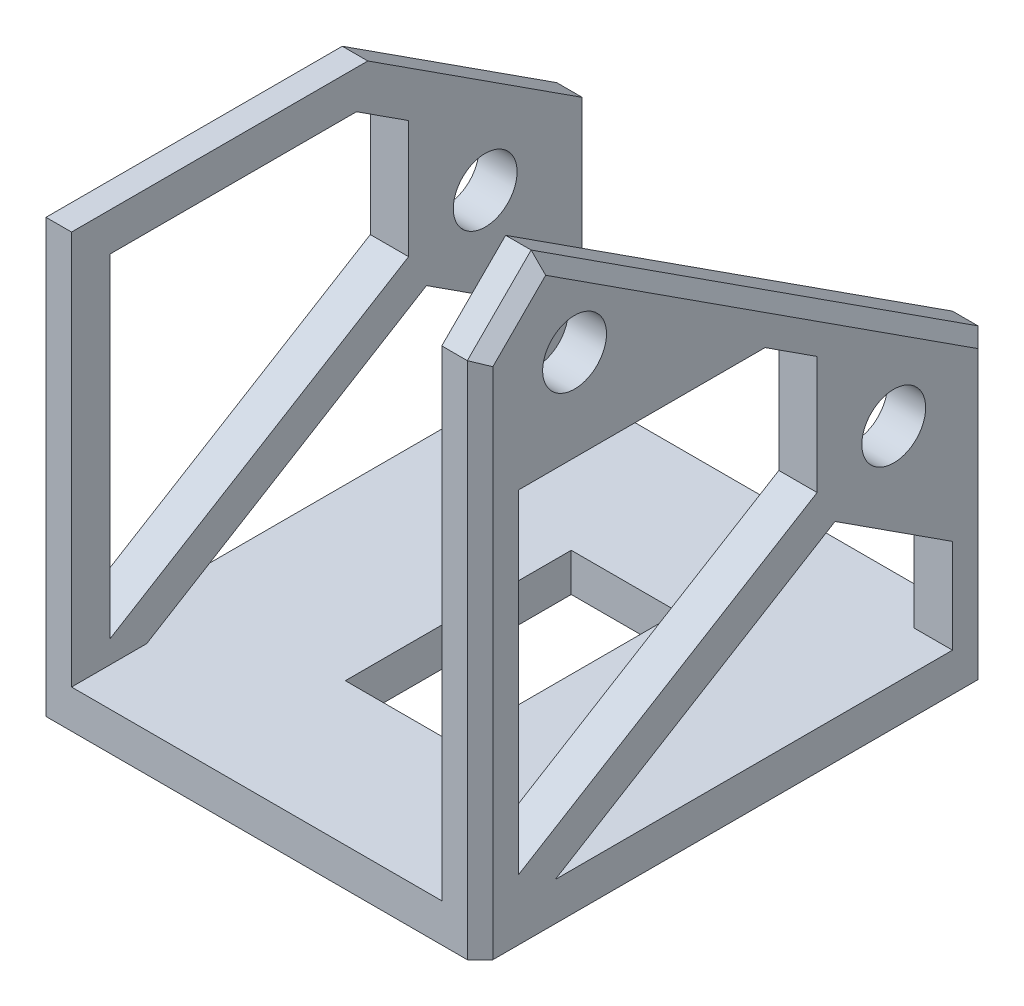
from build123d import *

# Parameters (mm, degrees)
CROQUIS1_W              = 35
CROQUIS1_H              = 40
CROQUIS1_W_2            = 8.413548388
CROQUIS1_H_2            = 17.69516129
SALIENTE_EXTRUIR2_DEPTH = 1.5
CROQUIS2_R              = 2.5
SALIENTE_EXTRUIR3_DEPTH = 3
SALIENTE_EXTRUIR4_START = -3
CROQUIS3_R              = 2.5
SALIENTE_EXTRUIR4_DEPTH = 3
CHAFL_N2_SIZE           = 1
CORTAR_EXTRUIR1_DEPTH   = 60.778382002


with BuildPart() as part:
    # Croquis1 → Saliente-Extruir2 (new, symmetric)
    with BuildSketch(Plane(origin=(0, 0, 0), x_dir=(1, 0, 0), z_dir=(0, 1, 0))):
        Rectangle(CROQUIS1_W, CROQUIS1_H)
        Rectangle(CROQUIS1_W_2, CROQUIS1_H_2, mode=Mode.SUBTRACT)
    extrude(amount=SALIENTE_EXTRUIR2_DEPTH, both=True)

    # Croquis2 → Saliente-Extruir3 (add)
    with BuildSketch(Plane(origin=(17.5, 0, 0), x_dir=(0, 0, -1), z_dir=(1, 0, 0))):
        Polygon((-20, 1.5), (-20, 39.141306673), (-15, 44.141306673), (20, 21.5), (20, 1.5), align=None)
        with Locations((12.400657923, 19)):
            Circle(CROQUIS2_R, mode=Mode.SUBTRACT)
        with Locations((-12.599342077, 36.51)):
            Circle(CROQUIS2_R, mode=Mode.SUBTRACT)
    extrude(amount=-SALIENTE_EXTRUIR3_DEPTH)

    # Croquis3 → Saliente-Extruir4 (add)
    with BuildSketch(Plane.ZY.offset(17.5).offset(SALIENTE_EXTRUIR4_START)):
        Polygon((-20, 1.5), (-20, 21.5), (-3.20733822, 32.363080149), (20, 32.363080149), (20, 1.5), align=None)
        with Locations(Location((-12.400657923, 19, 0), (0, 0, 180))):
            Circle(CROQUIS3_R, mode=Mode.SUBTRACT)
    extrude(amount=SALIENTE_EXTRUIR4_DEPTH)

    # Chafl_n2
    chafl_n2_edges = [part.edges().sort_by_distance(p)[0] for p in [
        (17.5, 32.820653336, -2.5),
        (17.5, 41.641306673, 17.5),
        (-17.5, 32.363080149, 8.39633089),
        (-17.5, 26.931540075, -11.60366911),
        (17.5, 18.820653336, 20),
        (-17.5, 15.431540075, 20),
        (-17.5, 10, -20),
        (17.5, 10, -20),
    ]]
    chamfer(chafl_n2_edges, length=CHAFL_N2_SIZE)

    # Croquis4 → Cortar-Extruir1 (cut, through all)
    with BuildSketch(Plane(origin=(17.5, 0, 0), x_dir=(0, 0, -1), z_dir=(1, 0, 0))):
        Polygon((17, 1.5), (17, 8.878732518), (7.799407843, 14.830544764), (-14.113834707, 1.5), align=None)
        Polygon((6.400657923, 26.724350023), (2.321584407, 29.363080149), (-17, 29.363080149), (-17, 3.255749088), (6.400657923, 17.491137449), align=None)
    extrude(amount=-CORTAR_EXTRUIR1_DEPTH, mode=Mode.SUBTRACT)


solid = part.part
